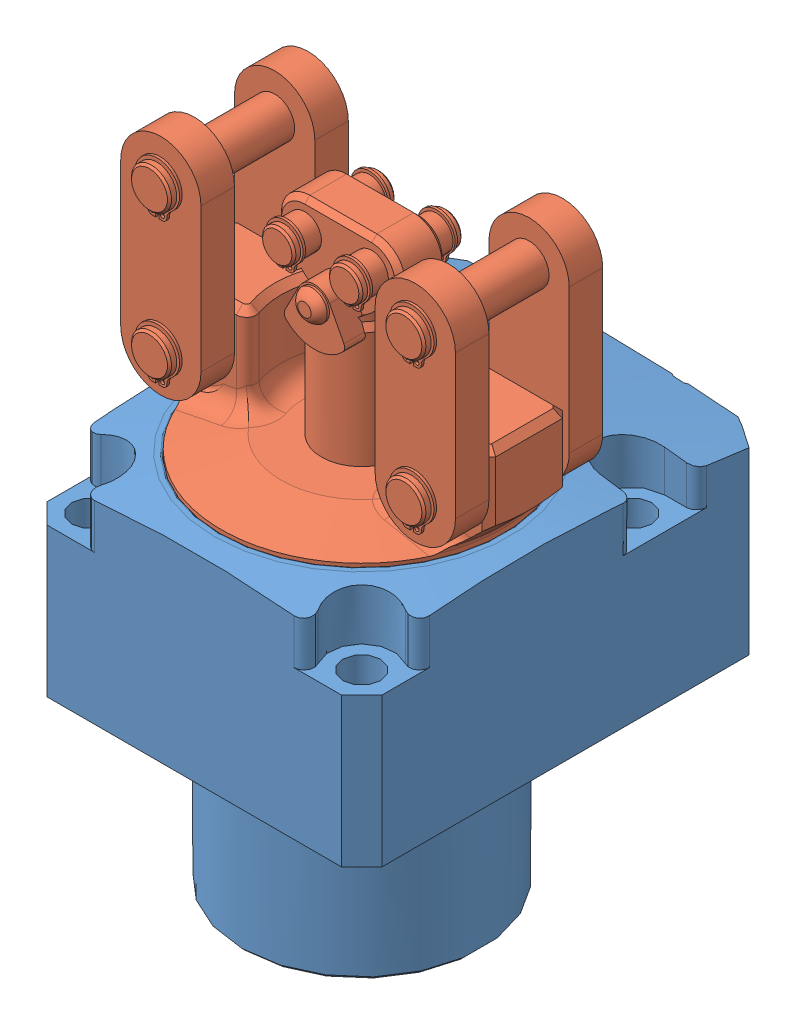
SolidWorks assembly ilcmv41621520.SLDASM, configuration Default (file format 13000). Lengths in mm.
Overall size (50.01 92.58 61.01).
2 component instances, 2 part files, 3 mates.
Components (placement in the parent):
- ilcmv41621520_BODY-1: ilcmv41621520_BODY.SLDPRT [Default] at (19.6482 28.4239 54.7403) size (50.01 55.8 61.01)
- ilcmv41621520_LUG-1: ilcmv41621520_LUG.SLDPRT [Default] at (19.6482 50.9283 54.7403) x (0 0 1) z (-1 0 0) size (41.94 44.48 49.99)
Mates (geometry in assembly coordinates):
- Concentric1: concentric anti-aligned: cylinder of ilmv41621520_BODY-1 through (19.6482 19.4549 54.7403) axis (0 -1 0) radius 21.0185; cylinder of ilmv41621520_LUG-1 through (19.6482 67.5596 54.7403) axis (0 1 0) radius 20.9677
- Coincident1: coincident anti-aligned: plane of ilmv41621520_BODY-1 through (40.6667 50.9283 54.7403) normal (0 1 0); plane of ilmv41621520_LUG-1 through (19.6482 50.9283 48.7459) normal (0 -1 0)
- Parallel1: parallel aligned: plane of ilmv41621520_BODY-1 through (-5.3556 58.6245 18.7332) normal (0 0 -1); plane of ilmv41621520_LUG-1 through (0.6526 89.4093 43.7421) normal (0 0 -1)
